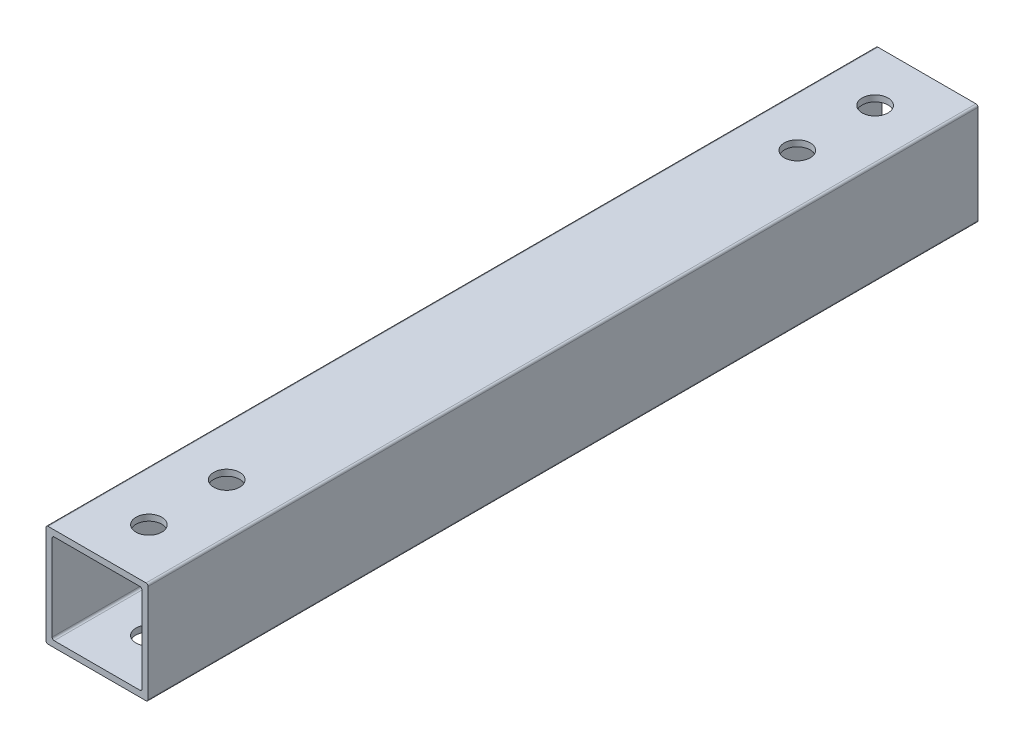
ISO-10303-21;
HEADER;
FILE_DESCRIPTION(('STEP AP214'),'2;1');
FILE_NAME('part.step','',(''),(''),'','','');
FILE_SCHEMA(('AUTOMOTIVE_DESIGN { 1 0 10303 214 1 1 1 1 }'));
ENDSEC;
DATA;
#1=APPLICATION_CONTEXT('core data for automotive mechanical design processes');
#2=APPLICATION_PROTOCOL_DEFINITION('international standard','automotive_design',2000,#1);
#3=PRODUCT_CONTEXT('',#1,'mechanical');
#4=PRODUCT('Part','Part','',(#3));
#5=PRODUCT_RELATED_PRODUCT_CATEGORY('part','',(#4));
#6=PRODUCT_DEFINITION_FORMATION('','',#4);
#7=PRODUCT_DEFINITION_CONTEXT('part definition',#1,'design');
#8=PRODUCT_DEFINITION('design','',#6,#7);
#9=PRODUCT_DEFINITION_SHAPE('','',#8);
#10=(LENGTH_UNIT() NAMED_UNIT(*) SI_UNIT(.MILLI.,.METRE.));
#11=(NAMED_UNIT(*) PLANE_ANGLE_UNIT() SI_UNIT($,.RADIAN.));
#12=(NAMED_UNIT(*) SI_UNIT($,.STERADIAN.) SOLID_ANGLE_UNIT());
#13=UNCERTAINTY_MEASURE_WITH_UNIT(LENGTH_MEASURE(1.E-05),#10,'distance_accuracy_value','');
#14=(GEOMETRIC_REPRESENTATION_CONTEXT(3) GLOBAL_UNCERTAINTY_ASSIGNED_CONTEXT((#13)) GLOBAL_UNIT_ASSIGNED_CONTEXT((#10,
#11,#12)) REPRESENTATION_CONTEXT('',''));
#15=CARTESIAN_POINT('',(0.,0.,0.));
#16=DIRECTION('',(0.,0.,1.));
#17=DIRECTION('',(1.,0.,0.));
#18=AXIS2_PLACEMENT_3D('',#15,#16,#17);
#19=CARTESIAN_POINT('',(-11.9999999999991,-11.9999999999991,-1796.8));
#20=DIRECTION('',(0.,0.,-1.));
#21=DIRECTION('',(-1.,0.,0.));
#22=AXIS2_PLACEMENT_3D('',#19,#20,#21);
#23=CYLINDRICAL_SURFACE('',#22,0.500000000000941);
#24=CARTESIAN_POINT('',(-11.9999999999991,-11.9999999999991,-2000.));
#25=DIRECTION('',(0.,0.,-1.));
#26=DIRECTION('',(-1.,0.,0.));
#27=AXIS2_PLACEMENT_3D('',#24,#25,#26);
#28=CIRCLE('',#27,0.500000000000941);
#29=CARTESIAN_POINT('',(-11.9999999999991,-12.5,-2000.));
#30=VERTEX_POINT('',#29);
#31=CARTESIAN_POINT('',(-12.5,-11.9999999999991,-2000.));
#32=VERTEX_POINT('',#31);
#33=EDGE_CURVE('E337',#30,#32,#28,.T.);
#34=ORIENTED_EDGE('',*,*,#33,.F.);
#35=DIRECTION('',(0.,0.,-1.));
#36=VECTOR('',#35,1.);
#37=CARTESIAN_POINT('',(-11.9999999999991,-12.5,-1796.8));
#38=LINE('',#37,#36);
#39=CARTESIAN_POINT('',(-11.9999999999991,-12.5,-1796.8));
#40=VERTEX_POINT('',#39);
#41=EDGE_CURVE('E12',#40,#30,#38,.T.);
#42=ORIENTED_EDGE('',*,*,#41,.F.);
#43=CARTESIAN_POINT('',(-11.9999999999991,-11.9999999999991,-1796.8));
#44=DIRECTION('',(0.,0.,-1.));
#45=DIRECTION('',(-1.,0.,0.));
#46=AXIS2_PLACEMENT_3D('',#43,#44,#45);
#47=CIRCLE('',#46,0.500000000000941);
#48=CARTESIAN_POINT('',(-12.5,-11.9999999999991,-1796.8));
#49=VERTEX_POINT('',#48);
#50=EDGE_CURVE('E233',#40,#49,#47,.T.);
#51=ORIENTED_EDGE('',*,*,#50,.T.);
#52=DIRECTION('',(0.,0.,-1.));
#53=VECTOR('',#52,1.);
#54=CARTESIAN_POINT('',(-12.5,-11.9999999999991,-1796.8));
#55=LINE('',#54,#53);
#56=EDGE_CURVE('E253',#49,#32,#55,.T.);
#57=ORIENTED_EDGE('',*,*,#56,.T.);
#58=EDGE_LOOP('',(#34,#42,#51,#57));
#59=FACE_BOUND('',#58,.T.);
#60=ADVANCED_FACE('F47',(#59),#23,.T.);
#61=CARTESIAN_POINT('',(11.9999999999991,-12.5,-1796.8));
#62=DIRECTION('',(0.,-1.,0.));
#63=DIRECTION('',(1.,0.,0.));
#64=AXIS2_PLACEMENT_3D('',#61,#62,#63);
#65=PLANE('',#64);
#66=CARTESIAN_POINT('',(0.,-12.5,-1987.3));
#67=DIRECTION('',(0.,-1.,0.));
#68=DIRECTION('',(1.,0.,0.));
#69=AXIS2_PLACEMENT_3D('',#66,#67,#68);
#70=CIRCLE('',#69,3.17500000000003);
#71=CARTESIAN_POINT('',(3.17500000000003,-12.5,-1987.3));
#72=VERTEX_POINT('',#71);
#73=EDGE_CURVE('E261',#72,#72,#70,.F.);
#74=ORIENTED_EDGE('',*,*,#73,.T.);
#75=EDGE_LOOP('',(#74));
#76=FACE_BOUND('',#75,.T.);
#77=CARTESIAN_POINT('',(0.,-12.5,-1968.25));
#78=DIRECTION('',(0.,-1.,0.));
#79=DIRECTION('',(1.,0.,0.));
#80=AXIS2_PLACEMENT_3D('',#77,#78,#79);
#81=CIRCLE('',#80,3.17500000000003);
#82=CARTESIAN_POINT('',(3.17500000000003,-12.5,-1968.25));
#83=VERTEX_POINT('',#82);
#84=EDGE_CURVE('E275',#83,#83,#81,.F.);
#85=ORIENTED_EDGE('',*,*,#84,.T.);
#86=EDGE_LOOP('',(#85));
#87=FACE_BOUND('',#86,.T.);
#88=CARTESIAN_POINT('',(0.,-12.5,-1828.55));
#89=DIRECTION('',(0.,-1.,0.));
#90=DIRECTION('',(1.,0.,0.));
#91=AXIS2_PLACEMENT_3D('',#88,#89,#90);
#92=CIRCLE('',#91,3.17500000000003);
#93=CARTESIAN_POINT('',(3.17500000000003,-12.5,-1828.55));
#94=VERTEX_POINT('',#93);
#95=EDGE_CURVE('E276',#94,#94,#92,.F.);
#96=ORIENTED_EDGE('',*,*,#95,.T.);
#97=EDGE_LOOP('',(#96));
#98=FACE_BOUND('',#97,.T.);
#99=CARTESIAN_POINT('',(0.,-12.5,-1809.5));
#100=DIRECTION('',(0.,-1.,0.));
#101=DIRECTION('',(1.,0.,0.));
#102=AXIS2_PLACEMENT_3D('',#99,#100,#101);
#103=CIRCLE('',#102,3.17500000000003);
#104=CARTESIAN_POINT('',(3.17500000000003,-12.5,-1809.5));
#105=VERTEX_POINT('',#104);
#106=EDGE_CURVE('E278',#105,#105,#103,.F.);
#107=ORIENTED_EDGE('',*,*,#106,.T.);
#108=EDGE_LOOP('',(#107));
#109=FACE_BOUND('',#108,.T.);
#110=DIRECTION('',(-1.,0.,0.));
#111=VECTOR('',#110,1.);
#112=CARTESIAN_POINT('',(11.9999999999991,-12.5,-2000.));
#113=LINE('',#112,#111);
#114=CARTESIAN_POINT('',(11.9999999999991,-12.5,-2000.));
#115=VERTEX_POINT('',#114);
#116=EDGE_CURVE('E237',#115,#30,#113,.T.);
#117=ORIENTED_EDGE('',*,*,#116,.F.);
#118=DIRECTION('',(0.,0.,-1.));
#119=VECTOR('',#118,1.);
#120=CARTESIAN_POINT('',(11.9999999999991,-12.5,-1796.8));
#121=LINE('',#120,#119);
#122=CARTESIAN_POINT('',(11.9999999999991,-12.5,-1796.8));
#123=VERTEX_POINT('',#122);
#124=EDGE_CURVE('E55',#123,#115,#121,.T.);
#125=ORIENTED_EDGE('',*,*,#124,.F.);
#126=DIRECTION('',(-1.,0.,0.));
#127=VECTOR('',#126,1.);
#128=CARTESIAN_POINT('',(11.9999999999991,-12.5,-1796.8));
#129=LINE('',#128,#127);
#130=EDGE_CURVE('E255',#123,#40,#129,.T.);
#131=ORIENTED_EDGE('',*,*,#130,.T.);
#132=ORIENTED_EDGE('',*,*,#41,.T.);
#133=EDGE_LOOP('',(#117,#125,#131,#132));
#134=FACE_BOUND('',#133,.T.);
#135=ADVANCED_FACE('F327',(#76,#87,#98,#109,#134),#65,.T.);
#136=CARTESIAN_POINT('',(11.9999999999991,-11.9999999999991,-1796.8));
#137=DIRECTION('',(0.,0.,-1.));
#138=DIRECTION('',(-1.,0.,0.));
#139=AXIS2_PLACEMENT_3D('',#136,#137,#138);
#140=CYLINDRICAL_SURFACE('',#139,0.500000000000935);
#141=CARTESIAN_POINT('',(11.9999999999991,-11.9999999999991,-2000.));
#142=DIRECTION('',(0.,0.,-1.));
#143=DIRECTION('',(-1.,0.,0.));
#144=AXIS2_PLACEMENT_3D('',#141,#142,#143);
#145=CIRCLE('',#144,0.500000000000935);
#146=CARTESIAN_POINT('',(12.5,-11.9999999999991,-2000.));
#147=VERTEX_POINT('',#146);
#148=EDGE_CURVE('E350',#147,#115,#145,.T.);
#149=ORIENTED_EDGE('',*,*,#148,.F.);
#150=DIRECTION('',(0.,0.,-1.));
#151=VECTOR('',#150,1.);
#152=CARTESIAN_POINT('',(12.5,-11.9999999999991,-1796.8));
#153=LINE('',#152,#151);
#154=CARTESIAN_POINT('',(12.5,-11.9999999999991,-1796.8));
#155=VERTEX_POINT('',#154);
#156=EDGE_CURVE('E358',#155,#147,#153,.T.);
#157=ORIENTED_EDGE('',*,*,#156,.F.);
#158=CARTESIAN_POINT('',(11.9999999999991,-11.9999999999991,-1796.8));
#159=DIRECTION('',(0.,0.,-1.));
#160=DIRECTION('',(-1.,0.,0.));
#161=AXIS2_PLACEMENT_3D('',#158,#159,#160);
#162=CIRCLE('',#161,0.500000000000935);
#163=EDGE_CURVE('E394',#155,#123,#162,.T.);
#164=ORIENTED_EDGE('',*,*,#163,.T.);
#165=ORIENTED_EDGE('',*,*,#124,.T.);
#166=EDGE_LOOP('',(#149,#157,#164,#165));
#167=FACE_BOUND('',#166,.T.);
#168=ADVANCED_FACE('F332',(#167),#140,.T.);
#169=CARTESIAN_POINT('',(12.5,11.9999999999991,-1796.8));
#170=DIRECTION('',(1.,0.,0.));
#171=DIRECTION('',(0.,1.,0.));
#172=AXIS2_PLACEMENT_3D('',#169,#170,#171);
#173=PLANE('',#172);
#174=DIRECTION('',(0.,-1.,0.));
#175=VECTOR('',#174,1.);
#176=CARTESIAN_POINT('',(12.5,11.9999999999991,-2000.));
#177=LINE('',#176,#175);
#178=CARTESIAN_POINT('',(12.5,11.9999999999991,-2000.));
#179=VERTEX_POINT('',#178);
#180=EDGE_CURVE('E353',#179,#147,#177,.T.);
#181=ORIENTED_EDGE('',*,*,#180,.F.);
#182=DIRECTION('',(0.,0.,-1.));
#183=VECTOR('',#182,1.);
#184=CARTESIAN_POINT('',(12.5,11.9999999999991,-1796.8));
#185=LINE('',#184,#183);
#186=CARTESIAN_POINT('',(12.5,11.9999999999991,-1796.8));
#187=VERTEX_POINT('',#186);
#188=EDGE_CURVE('E359',#187,#179,#185,.T.);
#189=ORIENTED_EDGE('',*,*,#188,.F.);
#190=DIRECTION('',(0.,-1.,0.));
#191=VECTOR('',#190,1.);
#192=CARTESIAN_POINT('',(12.5,11.9999999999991,-1796.8));
#193=LINE('',#192,#191);
#194=EDGE_CURVE('E390',#187,#155,#193,.T.);
#195=ORIENTED_EDGE('',*,*,#194,.T.);
#196=ORIENTED_EDGE('',*,*,#156,.T.);
#197=EDGE_LOOP('',(#181,#189,#195,#196));
#198=FACE_BOUND('',#197,.T.);
#199=ADVANCED_FACE('F387',(#198),#173,.T.);
#200=CARTESIAN_POINT('',(11.9999999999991,11.9999999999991,-1796.8));
#201=DIRECTION('',(0.,0.,-1.));
#202=DIRECTION('',(-1.,0.,0.));
#203=AXIS2_PLACEMENT_3D('',#200,#201,#202);
#204=CYLINDRICAL_SURFACE('',#203,0.500000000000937);
#205=CARTESIAN_POINT('',(11.9999999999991,11.9999999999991,-2000.));
#206=DIRECTION('',(0.,0.,-1.));
#207=DIRECTION('',(-1.,0.,0.));
#208=AXIS2_PLACEMENT_3D('',#205,#206,#207);
#209=CIRCLE('',#208,0.500000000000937);
#210=CARTESIAN_POINT('',(11.9999999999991,12.5,-2000.));
#211=VERTEX_POINT('',#210);
#212=EDGE_CURVE('E378',#211,#179,#209,.T.);
#213=ORIENTED_EDGE('',*,*,#212,.F.);
#214=DIRECTION('',(0.,0.,-1.));
#215=VECTOR('',#214,1.);
#216=CARTESIAN_POINT('',(11.9999999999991,12.5,-1796.8));
#217=LINE('',#216,#215);
#218=CARTESIAN_POINT('',(11.9999999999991,12.5,-1796.8));
#219=VERTEX_POINT('',#218);
#220=EDGE_CURVE('E249',#219,#211,#217,.T.);
#221=ORIENTED_EDGE('',*,*,#220,.F.);
#222=CARTESIAN_POINT('',(11.9999999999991,11.9999999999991,-1796.8));
#223=DIRECTION('',(0.,0.,-1.));
#224=DIRECTION('',(-1.,0.,0.));
#225=AXIS2_PLACEMENT_3D('',#222,#223,#224);
#226=CIRCLE('',#225,0.500000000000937);
#227=EDGE_CURVE('E409',#219,#187,#226,.T.);
#228=ORIENTED_EDGE('',*,*,#227,.T.);
#229=ORIENTED_EDGE('',*,*,#188,.T.);
#230=EDGE_LOOP('',(#213,#221,#228,#229));
#231=FACE_BOUND('',#230,.T.);
#232=ADVANCED_FACE('F379',(#231),#204,.T.);
#233=CARTESIAN_POINT('',(-11.9999999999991,12.5,-1796.8));
#234=DIRECTION('',(0.,1.,0.));
#235=DIRECTION('',(-1.,0.,0.));
#236=AXIS2_PLACEMENT_3D('',#233,#234,#235);
#237=PLANE('',#236);
#238=CARTESIAN_POINT('',(0.,12.5,-1987.3));
#239=DIRECTION('',(0.,1.,0.));
#240=DIRECTION('',(-1.,0.,0.));
#241=AXIS2_PLACEMENT_3D('',#238,#239,#240);
#242=CIRCLE('',#241,3.17500000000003);
#243=CARTESIAN_POINT('',(-3.17500000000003,12.5,-1987.3));
#244=VERTEX_POINT('',#243);
#245=EDGE_CURVE('E708',#244,#244,#242,.T.);
#246=ORIENTED_EDGE('',*,*,#245,.F.);
#247=EDGE_LOOP('',(#246));
#248=FACE_BOUND('',#247,.T.);
#249=CARTESIAN_POINT('',(0.,12.5,-1968.25));
#250=DIRECTION('',(0.,1.,0.));
#251=DIRECTION('',(-1.,0.,0.));
#252=AXIS2_PLACEMENT_3D('',#249,#250,#251);
#253=CIRCLE('',#252,3.17500000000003);
#254=CARTESIAN_POINT('',(-3.17500000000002,12.5,-1968.25));
#255=VERTEX_POINT('',#254);
#256=EDGE_CURVE('E711',#255,#255,#253,.T.);
#257=ORIENTED_EDGE('',*,*,#256,.F.);
#258=EDGE_LOOP('',(#257));
#259=FACE_BOUND('',#258,.T.);
#260=CARTESIAN_POINT('',(0.,12.5,-1828.55));
#261=DIRECTION('',(0.,1.,0.));
#262=DIRECTION('',(1.,0.,0.));
#263=AXIS2_PLACEMENT_3D('',#260,#261,#262);
#264=CIRCLE('',#263,3.17500000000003);
#265=CARTESIAN_POINT('',(3.17500000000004,12.5,-1828.55));
#266=VERTEX_POINT('',#265);
#267=EDGE_CURVE('E269',#266,#266,#264,.T.);
#268=ORIENTED_EDGE('',*,*,#267,.F.);
#269=EDGE_LOOP('',(#268));
#270=FACE_BOUND('',#269,.T.);
#271=CARTESIAN_POINT('',(0.,12.5,-1809.5));
#272=DIRECTION('',(0.,1.,0.));
#273=DIRECTION('',(1.,0.,0.));
#274=AXIS2_PLACEMENT_3D('',#271,#272,#273);
#275=CIRCLE('',#274,3.17500000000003);
#276=CARTESIAN_POINT('',(3.17500000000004,12.5,-1809.5));
#277=VERTEX_POINT('',#276);
#278=EDGE_CURVE('E282',#277,#277,#275,.T.);
#279=ORIENTED_EDGE('',*,*,#278,.F.);
#280=EDGE_LOOP('',(#279));
#281=FACE_BOUND('',#280,.T.);
#282=DIRECTION('',(1.,0.,0.));
#283=VECTOR('',#282,1.);
#284=CARTESIAN_POINT('',(-11.9999999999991,12.5,-2000.));
#285=LINE('',#284,#283);
#286=CARTESIAN_POINT('',(-11.9999999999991,12.5,-2000.));
#287=VERTEX_POINT('',#286);
#288=EDGE_CURVE('E372',#287,#211,#285,.T.);
#289=ORIENTED_EDGE('',*,*,#288,.F.);
#290=DIRECTION('',(0.,0.,-1.));
#291=VECTOR('',#290,1.);
#292=CARTESIAN_POINT('',(-11.9999999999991,12.5,-1796.8));
#293=LINE('',#292,#291);
#294=CARTESIAN_POINT('',(-11.9999999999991,12.5,-1796.8));
#295=VERTEX_POINT('',#294);
#296=EDGE_CURVE('E244',#295,#287,#293,.T.);
#297=ORIENTED_EDGE('',*,*,#296,.F.);
#298=DIRECTION('',(1.,0.,0.));
#299=VECTOR('',#298,1.);
#300=CARTESIAN_POINT('',(-11.9999999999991,12.5,-1796.8));
#301=LINE('',#300,#299);
#302=EDGE_CURVE('E375',#295,#219,#301,.T.);
#303=ORIENTED_EDGE('',*,*,#302,.T.);
#304=ORIENTED_EDGE('',*,*,#220,.T.);
#305=EDGE_LOOP('',(#289,#297,#303,#304));
#306=FACE_BOUND('',#305,.T.);
#307=ADVANCED_FACE('F370',(#248,#259,#270,#281,#306),#237,.T.);
#308=CARTESIAN_POINT('',(-11.9999999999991,11.9999999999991,-1796.8));
#309=DIRECTION('',(0.,0.,-1.));
#310=DIRECTION('',(-1.,0.,0.));
#311=AXIS2_PLACEMENT_3D('',#308,#309,#310);
#312=CYLINDRICAL_SURFACE('',#311,0.500000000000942);
#313=CARTESIAN_POINT('',(-11.9999999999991,11.9999999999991,-2000.));
#314=DIRECTION('',(0.,0.,-1.));
#315=DIRECTION('',(-1.,0.,0.));
#316=AXIS2_PLACEMENT_3D('',#313,#314,#315);
#317=CIRCLE('',#316,0.500000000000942);
#318=CARTESIAN_POINT('',(-12.5,11.9999999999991,-2000.));
#319=VERTEX_POINT('',#318);
#320=EDGE_CURVE('E382',#319,#287,#317,.T.);
#321=ORIENTED_EDGE('',*,*,#320,.F.);
#322=DIRECTION('',(0.,0.,-1.));
#323=VECTOR('',#322,1.);
#324=CARTESIAN_POINT('',(-12.5,11.9999999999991,-1796.8));
#325=LINE('',#324,#323);
#326=CARTESIAN_POINT('',(-12.5,11.9999999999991,-1796.8));
#327=VERTEX_POINT('',#326);
#328=EDGE_CURVE('E250',#327,#319,#325,.T.);
#329=ORIENTED_EDGE('',*,*,#328,.F.);
#330=CARTESIAN_POINT('',(-11.9999999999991,11.9999999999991,-1796.8));
#331=DIRECTION('',(0.,0.,-1.));
#332=DIRECTION('',(-1.,0.,0.));
#333=AXIS2_PLACEMENT_3D('',#330,#331,#332);
#334=CIRCLE('',#333,0.500000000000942);
#335=EDGE_CURVE('E242',#327,#295,#334,.T.);
#336=ORIENTED_EDGE('',*,*,#335,.T.);
#337=ORIENTED_EDGE('',*,*,#296,.T.);
#338=EDGE_LOOP('',(#321,#329,#336,#337));
#339=FACE_BOUND('',#338,.T.);
#340=ADVANCED_FACE('F408',(#339),#312,.T.);
#341=CARTESIAN_POINT('',(-12.5,-11.9999999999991,-1796.8));
#342=DIRECTION('',(-1.,0.,0.));
#343=DIRECTION('',(0.,0.,1.));
#344=AXIS2_PLACEMENT_3D('',#341,#342,#343);
#345=PLANE('',#344);
#346=DIRECTION('',(0.,1.,0.));
#347=VECTOR('',#346,1.);
#348=CARTESIAN_POINT('',(-12.5,-11.9999999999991,-2000.));
#349=LINE('',#348,#347);
#350=EDGE_CURVE('E343',#32,#319,#349,.T.);
#351=ORIENTED_EDGE('',*,*,#350,.F.);
#352=ORIENTED_EDGE('',*,*,#56,.F.);
#353=DIRECTION('',(0.,1.,0.));
#354=VECTOR('',#353,1.);
#355=CARTESIAN_POINT('',(-12.5,-11.9999999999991,-1796.8));
#356=LINE('',#355,#354);
#357=EDGE_CURVE('E236',#49,#327,#356,.T.);
#358=ORIENTED_EDGE('',*,*,#357,.T.);
#359=ORIENTED_EDGE('',*,*,#328,.T.);
#360=EDGE_LOOP('',(#351,#352,#358,#359));
#361=FACE_BOUND('',#360,.T.);
#362=ADVANCED_FACE('F403',(#361),#345,.T.);
#363=CARTESIAN_POINT('',(-11.9999999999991,-11.9999999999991,-1796.8));
#364=DIRECTION('',(0.,0.,-1.));
#365=DIRECTION('',(-1.,0.,0.));
#366=AXIS2_PLACEMENT_3D('',#363,#364,#365);
#367=PLANE('',#366);
#368=DIRECTION('',(0.,1.,0.));
#369=VECTOR('',#368,1.);
#370=CARTESIAN_POINT('',(-11.,10.4999999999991,-1796.8));
#371=LINE('',#370,#369);
#372=CARTESIAN_POINT('',(-11.,-10.4999999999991,-1796.8));
#373=VERTEX_POINT('',#372);
#374=CARTESIAN_POINT('',(-11.,10.4999999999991,-1796.8));
#375=VERTEX_POINT('',#374);
#376=EDGE_CURVE('E169',#373,#375,#371,.T.);
#377=ORIENTED_EDGE('',*,*,#376,.T.);
#378=CARTESIAN_POINT('',(-10.4999999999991,10.4999999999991,-1796.8));
#379=DIRECTION('',(0.,0.,-1.));
#380=DIRECTION('',(1.,0.,0.));
#381=AXIS2_PLACEMENT_3D('',#378,#379,#380);
#382=CIRCLE('',#381,0.500000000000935);
#383=CARTESIAN_POINT('',(-10.4999999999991,11.,-1796.8));
#384=VERTEX_POINT('',#383);
#385=EDGE_CURVE('E162',#375,#384,#382,.T.);
#386=ORIENTED_EDGE('',*,*,#385,.T.);
#387=DIRECTION('',(1.,0.,0.));
#388=VECTOR('',#387,1.);
#389=CARTESIAN_POINT('',(10.4999999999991,11.,-1796.8));
#390=LINE('',#389,#388);
#391=CARTESIAN_POINT('',(10.4999999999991,11.,-1796.8));
#392=VERTEX_POINT('',#391);
#393=EDGE_CURVE('E172',#384,#392,#390,.T.);
#394=ORIENTED_EDGE('',*,*,#393,.T.);
#395=CARTESIAN_POINT('',(10.4999999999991,10.4999999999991,-1796.8));
#396=DIRECTION('',(0.,0.,-1.));
#397=DIRECTION('',(1.,0.,0.));
#398=AXIS2_PLACEMENT_3D('',#395,#396,#397);
#399=CIRCLE('',#398,0.500000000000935);
#400=CARTESIAN_POINT('',(11.,10.4999999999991,-1796.8));
#401=VERTEX_POINT('',#400);
#402=EDGE_CURVE('E63',#392,#401,#399,.T.);
#403=ORIENTED_EDGE('',*,*,#402,.T.);
#404=DIRECTION('',(0.,-1.,0.));
#405=VECTOR('',#404,1.);
#406=CARTESIAN_POINT('',(11.,-10.4999999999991,-1796.8));
#407=LINE('',#406,#405);
#408=CARTESIAN_POINT('',(11.,-10.4999999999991,-1796.8));
#409=VERTEX_POINT('',#408);
#410=EDGE_CURVE('E191',#401,#409,#407,.T.);
#411=ORIENTED_EDGE('',*,*,#410,.T.);
#412=CARTESIAN_POINT('',(10.4999999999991,-10.4999999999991,-1796.8));
#413=DIRECTION('',(0.,0.,-1.));
#414=DIRECTION('',(1.,0.,0.));
#415=AXIS2_PLACEMENT_3D('',#412,#413,#414);
#416=CIRCLE('',#415,0.500000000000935);
#417=CARTESIAN_POINT('',(10.4999999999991,-11.,-1796.8));
#418=VERTEX_POINT('',#417);
#419=EDGE_CURVE('E194',#409,#418,#416,.T.);
#420=ORIENTED_EDGE('',*,*,#419,.T.);
#421=DIRECTION('',(-1.,0.,0.));
#422=VECTOR('',#421,1.);
#423=CARTESIAN_POINT('',(-10.4999999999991,-11.,-1796.8));
#424=LINE('',#423,#422);
#425=CARTESIAN_POINT('',(-10.4999999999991,-11.,-1796.8));
#426=VERTEX_POINT('',#425);
#427=EDGE_CURVE('E197',#418,#426,#424,.T.);
#428=ORIENTED_EDGE('',*,*,#427,.T.);
#429=CARTESIAN_POINT('',(-10.4999999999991,-10.4999999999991,-1796.8));
#430=DIRECTION('',(0.,0.,-1.));
#431=DIRECTION('',(1.,0.,0.));
#432=AXIS2_PLACEMENT_3D('',#429,#430,#431);
#433=CIRCLE('',#432,0.500000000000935);
#434=EDGE_CURVE('E200',#426,#373,#433,.T.);
#435=ORIENTED_EDGE('',*,*,#434,.T.);
#436=EDGE_LOOP('',(#377,#386,#394,#403,#411,#420,#428,#435));
#437=FACE_BOUND('',#436,.T.);
#438=ORIENTED_EDGE('',*,*,#50,.F.);
#439=ORIENTED_EDGE('',*,*,#130,.F.);
#440=ORIENTED_EDGE('',*,*,#163,.F.);
#441=ORIENTED_EDGE('',*,*,#194,.F.);
#442=ORIENTED_EDGE('',*,*,#227,.F.);
#443=ORIENTED_EDGE('',*,*,#302,.F.);
#444=ORIENTED_EDGE('',*,*,#335,.F.);
#445=ORIENTED_EDGE('',*,*,#357,.F.);
#446=EDGE_LOOP('',(#438,#439,#440,#441,#442,#443,#444,#445));
#447=FACE_BOUND('',#446,.T.);
#448=ADVANCED_FACE('F177',(#437,#447),#367,.F.);
#449=CARTESIAN_POINT('',(-11.9999999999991,-11.9999999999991,-2000.));
#450=DIRECTION('',(0.,0.,-1.));
#451=DIRECTION('',(-1.,0.,0.));
#452=AXIS2_PLACEMENT_3D('',#449,#450,#451);
#453=PLANE('',#452);
#454=CARTESIAN_POINT('',(-10.4999999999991,10.4999999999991,-2000.));
#455=DIRECTION('',(0.,0.,-1.));
#456=DIRECTION('',(1.,0.,0.));
#457=AXIS2_PLACEMENT_3D('',#454,#455,#456);
#458=CIRCLE('',#457,0.500000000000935);
#459=CARTESIAN_POINT('',(-11.,10.4999999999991,-2000.));
#460=VERTEX_POINT('',#459);
#461=CARTESIAN_POINT('',(-10.4999999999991,11.,-2000.));
#462=VERTEX_POINT('',#461);
#463=EDGE_CURVE('E71',#460,#462,#458,.T.);
#464=ORIENTED_EDGE('',*,*,#463,.F.);
#465=DIRECTION('',(0.,1.,0.));
#466=VECTOR('',#465,1.);
#467=CARTESIAN_POINT('',(-11.,10.4999999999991,-2000.));
#468=LINE('',#467,#466);
#469=CARTESIAN_POINT('',(-11.,-10.4999999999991,-2000.));
#470=VERTEX_POINT('',#469);
#471=EDGE_CURVE('E181',#470,#460,#468,.T.);
#472=ORIENTED_EDGE('',*,*,#471,.F.);
#473=CARTESIAN_POINT('',(-10.4999999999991,-10.4999999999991,-2000.));
#474=DIRECTION('',(0.,0.,-1.));
#475=DIRECTION('',(1.,0.,0.));
#476=AXIS2_PLACEMENT_3D('',#473,#474,#475);
#477=CIRCLE('',#476,0.500000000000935);
#478=CARTESIAN_POINT('',(-10.4999999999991,-11.,-2000.));
#479=VERTEX_POINT('',#478);
#480=EDGE_CURVE('E184',#479,#470,#477,.T.);
#481=ORIENTED_EDGE('',*,*,#480,.F.);
#482=DIRECTION('',(-1.,0.,0.));
#483=VECTOR('',#482,1.);
#484=CARTESIAN_POINT('',(-10.4999999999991,-11.,-2000.));
#485=LINE('',#484,#483);
#486=CARTESIAN_POINT('',(10.4999999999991,-11.,-2000.));
#487=VERTEX_POINT('',#486);
#488=EDGE_CURVE('E688',#487,#479,#485,.T.);
#489=ORIENTED_EDGE('',*,*,#488,.F.);
#490=CARTESIAN_POINT('',(10.4999999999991,-10.4999999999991,-2000.));
#491=DIRECTION('',(0.,0.,-1.));
#492=DIRECTION('',(1.,0.,0.));
#493=AXIS2_PLACEMENT_3D('',#490,#491,#492);
#494=CIRCLE('',#493,0.500000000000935);
#495=CARTESIAN_POINT('',(11.,-10.4999999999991,-2000.));
#496=VERTEX_POINT('',#495);
#497=EDGE_CURVE('E685',#496,#487,#494,.T.);
#498=ORIENTED_EDGE('',*,*,#497,.F.);
#499=DIRECTION('',(0.,-1.,0.));
#500=VECTOR('',#499,1.);
#501=CARTESIAN_POINT('',(11.,-10.4999999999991,-2000.));
#502=LINE('',#501,#500);
#503=CARTESIAN_POINT('',(11.,10.4999999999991,-2000.));
#504=VERTEX_POINT('',#503);
#505=EDGE_CURVE('E680',#504,#496,#502,.T.);
#506=ORIENTED_EDGE('',*,*,#505,.F.);
#507=CARTESIAN_POINT('',(10.4999999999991,10.4999999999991,-2000.));
#508=DIRECTION('',(0.,0.,-1.));
#509=DIRECTION('',(1.,0.,0.));
#510=AXIS2_PLACEMENT_3D('',#507,#508,#509);
#511=CIRCLE('',#510,0.500000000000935);
#512=CARTESIAN_POINT('',(10.4999999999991,11.,-2000.));
#513=VERTEX_POINT('',#512);
#514=EDGE_CURVE('E677',#513,#504,#511,.T.);
#515=ORIENTED_EDGE('',*,*,#514,.F.);
#516=DIRECTION('',(1.,0.,0.));
#517=VECTOR('',#516,1.);
#518=CARTESIAN_POINT('',(10.4999999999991,11.,-2000.));
#519=LINE('',#518,#517);
#520=EDGE_CURVE('E676',#462,#513,#519,.T.);
#521=ORIENTED_EDGE('',*,*,#520,.F.);
#522=EDGE_LOOP('',(#464,#472,#481,#489,#498,#506,#515,#521));
#523=FACE_BOUND('',#522,.T.);
#524=ORIENTED_EDGE('',*,*,#33,.T.);
#525=ORIENTED_EDGE('',*,*,#350,.T.);
#526=ORIENTED_EDGE('',*,*,#320,.T.);
#527=ORIENTED_EDGE('',*,*,#288,.T.);
#528=ORIENTED_EDGE('',*,*,#212,.T.);
#529=ORIENTED_EDGE('',*,*,#180,.T.);
#530=ORIENTED_EDGE('',*,*,#148,.T.);
#531=ORIENTED_EDGE('',*,*,#116,.T.);
#532=EDGE_LOOP('',(#524,#525,#526,#527,#528,#529,#530,#531));
#533=FACE_BOUND('',#532,.T.);
#534=ADVANCED_FACE('F347',(#523,#533),#453,.T.);
#535=CARTESIAN_POINT('',(-10.4999999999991,10.4999999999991,-1796.8));
#536=DIRECTION('',(0.,0.,-1.));
#537=DIRECTION('',(-1.,0.,0.));
#538=AXIS2_PLACEMENT_3D('',#535,#536,#537);
#539=CYLINDRICAL_SURFACE('',#538,0.500000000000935);
#540=ORIENTED_EDGE('',*,*,#463,.T.);
#541=DIRECTION('',(0.,0.,-1.));
#542=VECTOR('',#541,1.);
#543=CARTESIAN_POINT('',(-10.4999999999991,11.,-1796.8));
#544=LINE('',#543,#542);
#545=EDGE_CURVE('E158',#384,#462,#544,.T.);
#546=ORIENTED_EDGE('',*,*,#545,.F.);
#547=ORIENTED_EDGE('',*,*,#385,.F.);
#548=DIRECTION('',(0.,0.,-1.));
#549=VECTOR('',#548,1.);
#550=CARTESIAN_POINT('',(-11.,10.4999999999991,-1796.8));
#551=LINE('',#550,#549);
#552=EDGE_CURVE('E220',#375,#460,#551,.T.);
#553=ORIENTED_EDGE('',*,*,#552,.T.);
#554=EDGE_LOOP('',(#540,#546,#547,#553));
#555=FACE_BOUND('',#554,.T.);
#556=ADVANCED_FACE('F160',(#555),#539,.F.);
#557=CARTESIAN_POINT('',(-11.,10.4999999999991,-1796.8));
#558=DIRECTION('',(-1.,0.,0.));
#559=DIRECTION('',(0.,-1.,0.));
#560=AXIS2_PLACEMENT_3D('',#557,#558,#559);
#561=PLANE('',#560);
#562=ORIENTED_EDGE('',*,*,#471,.T.);
#563=ORIENTED_EDGE('',*,*,#552,.F.);
#564=ORIENTED_EDGE('',*,*,#376,.F.);
#565=DIRECTION('',(0.,0.,-1.));
#566=VECTOR('',#565,1.);
#567=CARTESIAN_POINT('',(-11.,-10.4999999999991,-1796.8));
#568=LINE('',#567,#566);
#569=EDGE_CURVE('E215',#373,#470,#568,.T.);
#570=ORIENTED_EDGE('',*,*,#569,.T.);
#571=EDGE_LOOP('',(#562,#563,#564,#570));
#572=FACE_BOUND('',#571,.T.);
#573=ADVANCED_FACE('F465',(#572),#561,.F.);
#574=CARTESIAN_POINT('',(-10.4999999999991,-10.4999999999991,-1796.8));
#575=DIRECTION('',(0.,0.,-1.));
#576=DIRECTION('',(-1.,0.,0.));
#577=AXIS2_PLACEMENT_3D('',#574,#575,#576);
#578=CYLINDRICAL_SURFACE('',#577,0.500000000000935);
#579=ORIENTED_EDGE('',*,*,#480,.T.);
#580=ORIENTED_EDGE('',*,*,#569,.F.);
#581=ORIENTED_EDGE('',*,*,#434,.F.);
#582=DIRECTION('',(0.,0.,-1.));
#583=VECTOR('',#582,1.);
#584=CARTESIAN_POINT('',(-10.4999999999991,-11.,-1796.8));
#585=LINE('',#584,#583);
#586=EDGE_CURVE('E221',#426,#479,#585,.T.);
#587=ORIENTED_EDGE('',*,*,#586,.T.);
#588=EDGE_LOOP('',(#579,#580,#581,#587));
#589=FACE_BOUND('',#588,.T.);
#590=ADVANCED_FACE('F474',(#589),#578,.F.);
#591=CARTESIAN_POINT('',(-10.4999999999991,-11.,-1796.8));
#592=DIRECTION('',(0.,-1.,0.));
#593=DIRECTION('',(0.,0.,-1.));
#594=AXIS2_PLACEMENT_3D('',#591,#592,#593);
#595=PLANE('',#594);
#596=CARTESIAN_POINT('',(0.,-11.,-1987.3));
#597=DIRECTION('',(0.,-1.,0.));
#598=DIRECTION('',(0.,0.,-1.));
#599=AXIS2_PLACEMENT_3D('',#596,#597,#598);
#600=CIRCLE('',#599,3.17500000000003);
#601=CARTESIAN_POINT('',(0.,-11.,-1990.475));
#602=VERTEX_POINT('',#601);
#603=EDGE_CURVE('E187',#602,#602,#600,.T.);
#604=ORIENTED_EDGE('',*,*,#603,.T.);
#605=EDGE_LOOP('',(#604));
#606=FACE_BOUND('',#605,.T.);
#607=CARTESIAN_POINT('',(0.,-11.,-1968.25));
#608=DIRECTION('',(0.,-1.,0.));
#609=DIRECTION('',(0.,0.,-1.));
#610=AXIS2_PLACEMENT_3D('',#607,#608,#609);
#611=CIRCLE('',#610,3.17500000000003);
#612=CARTESIAN_POINT('',(0.,-11.,-1971.425));
#613=VERTEX_POINT('',#612);
#614=EDGE_CURVE('E294',#613,#613,#611,.T.);
#615=ORIENTED_EDGE('',*,*,#614,.T.);
#616=EDGE_LOOP('',(#615));
#617=FACE_BOUND('',#616,.T.);
#618=CARTESIAN_POINT('',(0.,-11.,-1828.55));
#619=DIRECTION('',(0.,-1.,0.));
#620=DIRECTION('',(0.,0.,-1.));
#621=AXIS2_PLACEMENT_3D('',#618,#619,#620);
#622=CIRCLE('',#621,3.17500000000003);
#623=CARTESIAN_POINT('',(0.,-11.,-1831.725));
#624=VERTEX_POINT('',#623);
#625=EDGE_CURVE('E290',#624,#624,#622,.T.);
#626=ORIENTED_EDGE('',*,*,#625,.T.);
#627=EDGE_LOOP('',(#626));
#628=FACE_BOUND('',#627,.T.);
#629=CARTESIAN_POINT('',(0.,-11.,-1809.5));
#630=DIRECTION('',(0.,-1.,0.));
#631=DIRECTION('',(0.,0.,-1.));
#632=AXIS2_PLACEMENT_3D('',#629,#630,#631);
#633=CIRCLE('',#632,3.17500000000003);
#634=CARTESIAN_POINT('',(0.,-11.,-1812.675));
#635=VERTEX_POINT('',#634);
#636=EDGE_CURVE('E260',#635,#635,#633,.T.);
#637=ORIENTED_EDGE('',*,*,#636,.T.);
#638=EDGE_LOOP('',(#637));
#639=FACE_BOUND('',#638,.T.);
#640=ORIENTED_EDGE('',*,*,#488,.T.);
#641=ORIENTED_EDGE('',*,*,#586,.F.);
#642=ORIENTED_EDGE('',*,*,#427,.F.);
#643=DIRECTION('',(0.,0.,-1.));
#644=VECTOR('',#643,1.);
#645=CARTESIAN_POINT('',(10.4999999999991,-11.,-1796.8));
#646=LINE('',#645,#644);
#647=EDGE_CURVE('E224',#418,#487,#646,.T.);
#648=ORIENTED_EDGE('',*,*,#647,.T.);
#649=EDGE_LOOP('',(#640,#641,#642,#648));
#650=FACE_BOUND('',#649,.T.);
#651=ADVANCED_FACE('F485',(#606,#617,#628,#639,#650),#595,.F.);
#652=CARTESIAN_POINT('',(10.4999999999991,-10.4999999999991,-1796.8));
#653=DIRECTION('',(0.,0.,-1.));
#654=DIRECTION('',(-1.,0.,0.));
#655=AXIS2_PLACEMENT_3D('',#652,#653,#654);
#656=CYLINDRICAL_SURFACE('',#655,0.500000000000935);
#657=ORIENTED_EDGE('',*,*,#497,.T.);
#658=ORIENTED_EDGE('',*,*,#647,.F.);
#659=ORIENTED_EDGE('',*,*,#419,.F.);
#660=DIRECTION('',(0.,0.,-1.));
#661=VECTOR('',#660,1.);
#662=CARTESIAN_POINT('',(11.,-10.4999999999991,-1796.8));
#663=LINE('',#662,#661);
#664=EDGE_CURVE('E227',#409,#496,#663,.T.);
#665=ORIENTED_EDGE('',*,*,#664,.T.);
#666=EDGE_LOOP('',(#657,#658,#659,#665));
#667=FACE_BOUND('',#666,.T.);
#668=ADVANCED_FACE('F494',(#667),#656,.F.);
#669=CARTESIAN_POINT('',(11.,-10.4999999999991,-1796.8));
#670=DIRECTION('',(1.,0.,0.));
#671=DIRECTION('',(0.,0.,-1.));
#672=AXIS2_PLACEMENT_3D('',#669,#670,#671);
#673=PLANE('',#672);
#674=ORIENTED_EDGE('',*,*,#505,.T.);
#675=ORIENTED_EDGE('',*,*,#664,.F.);
#676=ORIENTED_EDGE('',*,*,#410,.F.);
#677=DIRECTION('',(0.,0.,-1.));
#678=VECTOR('',#677,1.);
#679=CARTESIAN_POINT('',(11.,10.4999999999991,-1796.8));
#680=LINE('',#679,#678);
#681=EDGE_CURVE('E229',#401,#504,#680,.T.);
#682=ORIENTED_EDGE('',*,*,#681,.T.);
#683=EDGE_LOOP('',(#674,#675,#676,#682));
#684=FACE_BOUND('',#683,.T.);
#685=ADVANCED_FACE('F499',(#684),#673,.F.);
#686=CARTESIAN_POINT('',(10.4999999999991,10.4999999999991,-1796.8));
#687=DIRECTION('',(0.,0.,-1.));
#688=DIRECTION('',(-1.,0.,0.));
#689=AXIS2_PLACEMENT_3D('',#686,#687,#688);
#690=CYLINDRICAL_SURFACE('',#689,0.500000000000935);
#691=ORIENTED_EDGE('',*,*,#514,.T.);
#692=ORIENTED_EDGE('',*,*,#681,.F.);
#693=ORIENTED_EDGE('',*,*,#402,.F.);
#694=DIRECTION('',(0.,0.,-1.));
#695=VECTOR('',#694,1.);
#696=CARTESIAN_POINT('',(10.4999999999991,11.,-1796.8));
#697=LINE('',#696,#695);
#698=EDGE_CURVE('E168',#392,#513,#697,.T.);
#699=ORIENTED_EDGE('',*,*,#698,.T.);
#700=EDGE_LOOP('',(#691,#692,#693,#699));
#701=FACE_BOUND('',#700,.T.);
#702=ADVANCED_FACE('F510',(#701),#690,.F.);
#703=CARTESIAN_POINT('',(10.4999999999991,11.,-1796.8));
#704=DIRECTION('',(0.,1.,0.));
#705=DIRECTION('',(-1.,0.,0.));
#706=AXIS2_PLACEMENT_3D('',#703,#704,#705);
#707=PLANE('',#706);
#708=CARTESIAN_POINT('',(0.,11.,-1987.3));
#709=DIRECTION('',(0.,1.,0.));
#710=DIRECTION('',(-1.,0.,0.));
#711=AXIS2_PLACEMENT_3D('',#708,#709,#710);
#712=CIRCLE('',#711,3.17500000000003);
#713=CARTESIAN_POINT('',(-3.17500000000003,11.,-1987.3));
#714=VERTEX_POINT('',#713);
#715=EDGE_CURVE('E50',#714,#714,#712,.T.);
#716=ORIENTED_EDGE('',*,*,#715,.T.);
#717=EDGE_LOOP('',(#716));
#718=FACE_BOUND('',#717,.T.);
#719=CARTESIAN_POINT('',(0.,11.,-1968.25));
#720=DIRECTION('',(0.,1.,0.));
#721=DIRECTION('',(-1.,0.,0.));
#722=AXIS2_PLACEMENT_3D('',#719,#720,#721);
#723=CIRCLE('',#722,3.17500000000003);
#724=CARTESIAN_POINT('',(-3.17500000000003,11.,-1968.25));
#725=VERTEX_POINT('',#724);
#726=EDGE_CURVE('E293',#725,#725,#723,.T.);
#727=ORIENTED_EDGE('',*,*,#726,.T.);
#728=EDGE_LOOP('',(#727));
#729=FACE_BOUND('',#728,.T.);
#730=CARTESIAN_POINT('',(0.,11.,-1828.55));
#731=DIRECTION('',(0.,1.,0.));
#732=DIRECTION('',(-1.,0.,0.));
#733=AXIS2_PLACEMENT_3D('',#730,#731,#732);
#734=CIRCLE('',#733,3.17500000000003);
#735=CARTESIAN_POINT('',(-3.17500000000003,11.,-1828.55));
#736=VERTEX_POINT('',#735);
#737=EDGE_CURVE('E262',#736,#736,#734,.T.);
#738=ORIENTED_EDGE('',*,*,#737,.T.);
#739=EDGE_LOOP('',(#738));
#740=FACE_BOUND('',#739,.T.);
#741=CARTESIAN_POINT('',(0.,11.,-1809.5));
#742=DIRECTION('',(0.,1.,0.));
#743=DIRECTION('',(-1.,0.,0.));
#744=AXIS2_PLACEMENT_3D('',#741,#742,#743);
#745=CIRCLE('',#744,3.17500000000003);
#746=CARTESIAN_POINT('',(-3.17500000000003,11.,-1809.5));
#747=VERTEX_POINT('',#746);
#748=EDGE_CURVE('E256',#747,#747,#745,.T.);
#749=ORIENTED_EDGE('',*,*,#748,.T.);
#750=EDGE_LOOP('',(#749));
#751=FACE_BOUND('',#750,.T.);
#752=ORIENTED_EDGE('',*,*,#520,.T.);
#753=ORIENTED_EDGE('',*,*,#698,.F.);
#754=ORIENTED_EDGE('',*,*,#393,.F.);
#755=ORIENTED_EDGE('',*,*,#545,.T.);
#756=EDGE_LOOP('',(#752,#753,#754,#755));
#757=FACE_BOUND('',#756,.T.);
#758=ADVANCED_FACE('F173',(#718,#729,#740,#751,#757),#707,.F.);
#759=CARTESIAN_POINT('',(0.,-21.4802561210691,-1809.5));
#760=DIRECTION('',(0.,1.,0.));
#761=DIRECTION('',(-1.,0.,0.));
#762=AXIS2_PLACEMENT_3D('',#759,#760,#761);
#763=CYLINDRICAL_SURFACE('',#762,3.17500000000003);
#764=ORIENTED_EDGE('',*,*,#278,.T.);
#765=EDGE_LOOP('',(#764));
#766=FACE_BOUND('',#765,.T.);
#767=ORIENTED_EDGE('',*,*,#748,.F.);
#768=EDGE_LOOP('',(#767));
#769=FACE_BOUND('',#768,.T.);
#770=ADVANCED_FACE('F319',(#766,#769),#763,.F.);
#771=CARTESIAN_POINT('',(0.,-21.4802561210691,-1828.55));
#772=DIRECTION('',(0.,1.,0.));
#773=DIRECTION('',(-1.,0.,0.));
#774=AXIS2_PLACEMENT_3D('',#771,#772,#773);
#775=CYLINDRICAL_SURFACE('',#774,3.17500000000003);
#776=ORIENTED_EDGE('',*,*,#267,.T.);
#777=EDGE_LOOP('',(#776));
#778=FACE_BOUND('',#777,.T.);
#779=ORIENTED_EDGE('',*,*,#737,.F.);
#780=EDGE_LOOP('',(#779));
#781=FACE_BOUND('',#780,.T.);
#782=ADVANCED_FACE('F307',(#778,#781),#775,.F.);
#783=CARTESIAN_POINT('',(0.,-21.4802561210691,-1968.25));
#784=DIRECTION('',(0.,1.,0.));
#785=DIRECTION('',(-1.,0.,0.));
#786=AXIS2_PLACEMENT_3D('',#783,#784,#785);
#787=CYLINDRICAL_SURFACE('',#786,3.17500000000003);
#788=ORIENTED_EDGE('',*,*,#256,.T.);
#789=EDGE_LOOP('',(#788));
#790=FACE_BOUND('',#789,.T.);
#791=ORIENTED_EDGE('',*,*,#726,.F.);
#792=EDGE_LOOP('',(#791));
#793=FACE_BOUND('',#792,.T.);
#794=ADVANCED_FACE('F304',(#790,#793),#787,.F.);
#795=CARTESIAN_POINT('',(0.,-21.4802561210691,-1987.3));
#796=DIRECTION('',(0.,1.,0.));
#797=DIRECTION('',(-1.,0.,0.));
#798=AXIS2_PLACEMENT_3D('',#795,#796,#797);
#799=CYLINDRICAL_SURFACE('',#798,3.17500000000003);
#800=ORIENTED_EDGE('',*,*,#245,.T.);
#801=EDGE_LOOP('',(#800));
#802=FACE_BOUND('',#801,.T.);
#803=ORIENTED_EDGE('',*,*,#715,.F.);
#804=EDGE_LOOP('',(#803));
#805=FACE_BOUND('',#804,.T.);
#806=ADVANCED_FACE('F306',(#802,#805),#799,.F.);
#807=ORIENTED_EDGE('',*,*,#106,.F.);
#808=EDGE_LOOP('',(#807));
#809=FACE_BOUND('',#808,.T.);
#810=ORIENTED_EDGE('',*,*,#636,.F.);
#811=EDGE_LOOP('',(#810));
#812=FACE_BOUND('',#811,.T.);
#813=ADVANCED_FACE('F315',(#809,#812),#763,.F.);
#814=ORIENTED_EDGE('',*,*,#95,.F.);
#815=EDGE_LOOP('',(#814));
#816=FACE_BOUND('',#815,.T.);
#817=ORIENTED_EDGE('',*,*,#625,.F.);
#818=EDGE_LOOP('',(#817));
#819=FACE_BOUND('',#818,.T.);
#820=ADVANCED_FACE('F322',(#816,#819),#775,.F.);
#821=ORIENTED_EDGE('',*,*,#84,.F.);
#822=EDGE_LOOP('',(#821));
#823=FACE_BOUND('',#822,.T.);
#824=ORIENTED_EDGE('',*,*,#614,.F.);
#825=EDGE_LOOP('',(#824));
#826=FACE_BOUND('',#825,.T.);
#827=ADVANCED_FACE('F310',(#823,#826),#787,.F.);
#828=ORIENTED_EDGE('',*,*,#73,.F.);
#829=EDGE_LOOP('',(#828));
#830=FACE_BOUND('',#829,.T.);
#831=ORIENTED_EDGE('',*,*,#603,.F.);
#832=EDGE_LOOP('',(#831));
#833=FACE_BOUND('',#832,.T.);
#834=ADVANCED_FACE('F318',(#830,#833),#799,.F.);
#835=CLOSED_SHELL('',(#60,#135,#168,#199,#232,#307,#340,#362,#448,#534,#556,#573,#590,#651,#668,
#685,#702,#758,#770,#782,#794,#806,#813,#820,#827,#834));
#836=MANIFOLD_SOLID_BREP('B2',#835);
#837=ADVANCED_BREP_SHAPE_REPRESENTATION('',(#18,#836),#14);
#838=SHAPE_DEFINITION_REPRESENTATION(#9,#837);
ENDSEC;
END-ISO-10303-21;
